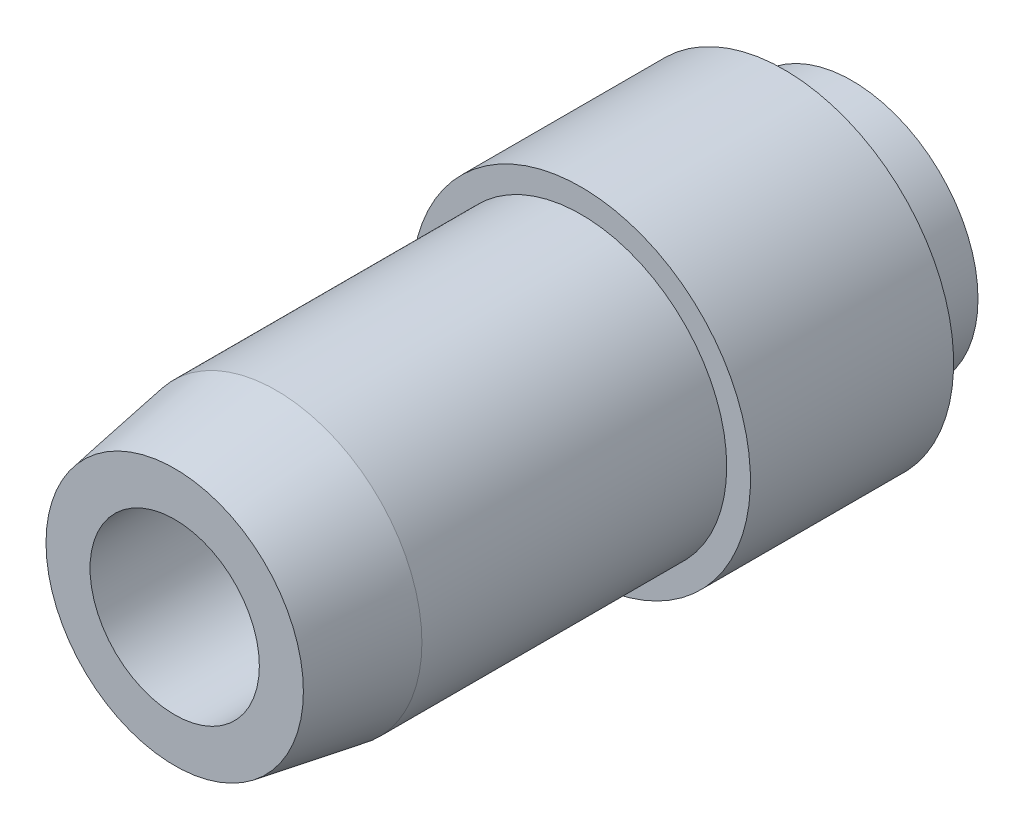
ISO-10303-21;
HEADER;
FILE_DESCRIPTION(('STEP AP214'),'2;1');
FILE_NAME('part.step','',(''),(''),'','','');
FILE_SCHEMA(('AUTOMOTIVE_DESIGN { 1 0 10303 214 1 1 1 1 }'));
ENDSEC;
DATA;
#1=APPLICATION_CONTEXT('core data for automotive mechanical design processes');
#2=APPLICATION_PROTOCOL_DEFINITION('international standard','automotive_design',2000,#1);
#3=PRODUCT_CONTEXT('',#1,'mechanical');
#4=PRODUCT('Part','Part','',(#3));
#5=PRODUCT_RELATED_PRODUCT_CATEGORY('part','',(#4));
#6=PRODUCT_DEFINITION_FORMATION('','',#4);
#7=PRODUCT_DEFINITION_CONTEXT('part definition',#1,'design');
#8=PRODUCT_DEFINITION('design','',#6,#7);
#9=PRODUCT_DEFINITION_SHAPE('','',#8);
#10=(LENGTH_UNIT() NAMED_UNIT(*) SI_UNIT(.MILLI.,.METRE.));
#11=(NAMED_UNIT(*) PLANE_ANGLE_UNIT() SI_UNIT($,.RADIAN.));
#12=(NAMED_UNIT(*) SI_UNIT($,.STERADIAN.) SOLID_ANGLE_UNIT());
#13=UNCERTAINTY_MEASURE_WITH_UNIT(LENGTH_MEASURE(1.E-05),#10,'distance_accuracy_value','');
#14=(GEOMETRIC_REPRESENTATION_CONTEXT(3) GLOBAL_UNCERTAINTY_ASSIGNED_CONTEXT((#13)) GLOBAL_UNIT_ASSIGNED_CONTEXT((#10,
#11,#12)) REPRESENTATION_CONTEXT('',''));
#15=CARTESIAN_POINT('',(0.,0.,0.));
#16=DIRECTION('',(0.,0.,1.));
#17=DIRECTION('',(1.,0.,0.));
#18=AXIS2_PLACEMENT_3D('',#15,#16,#17);
#19=CARTESIAN_POINT('',(0.,0.,10.16));
#20=DIRECTION('',(0.,0.,1.));
#21=DIRECTION('',(1.,0.,0.));
#22=AXIS2_PLACEMENT_3D('',#19,#20,#21);
#23=PLANE('',#22);
#24=CARTESIAN_POINT('',(0.,0.,10.16));
#25=DIRECTION('',(0.,0.,1.));
#26=DIRECTION('',(1.,0.,0.));
#27=AXIS2_PLACEMENT_3D('',#24,#25,#26);
#28=CIRCLE('',#27,6.35);
#29=CARTESIAN_POINT('',(-6.35,0.,10.16));
#30=VERTEX_POINT('',#29);
#31=EDGE_CURVE('E49',#30,#30,#28,.T.);
#32=ORIENTED_EDGE('',*,*,#31,.T.);
#33=EDGE_LOOP('',(#32));
#34=FACE_BOUND('',#33,.T.);
#35=CARTESIAN_POINT('',(0.,0.,10.16));
#36=DIRECTION('',(0.,0.,1.));
#37=DIRECTION('',(1.,0.,0.));
#38=AXIS2_PLACEMENT_3D('',#35,#36,#37);
#39=CIRCLE('',#38,5.461);
#40=CARTESIAN_POINT('',(-5.461,0.,10.16));
#41=VERTEX_POINT('',#40);
#42=EDGE_CURVE('E55',#41,#41,#39,.T.);
#43=ORIENTED_EDGE('',*,*,#42,.F.);
#44=EDGE_LOOP('',(#43));
#45=FACE_BOUND('',#44,.T.);
#46=ADVANCED_FACE('F29',(#34,#45),#23,.T.);
#47=CARTESIAN_POINT('',(0.,0.,2.54));
#48=DIRECTION('',(0.,0.,-1.));
#49=DIRECTION('',(-1.,0.,0.));
#50=AXIS2_PLACEMENT_3D('',#47,#48,#49);
#51=CYLINDRICAL_SURFACE('',#50,4.7244);
#52=CARTESIAN_POINT('',(0.,0.,2.54));
#53=DIRECTION('',(0.,0.,1.));
#54=DIRECTION('',(1.,0.,0.));
#55=AXIS2_PLACEMENT_3D('',#52,#53,#54);
#56=CIRCLE('',#55,4.7244);
#57=CARTESIAN_POINT('',(4.7244,0.,2.54));
#58=VERTEX_POINT('',#57);
#59=EDGE_CURVE('E40',#58,#58,#56,.T.);
#60=ORIENTED_EDGE('',*,*,#59,.F.);
#61=EDGE_LOOP('',(#60));
#62=FACE_BOUND('',#61,.T.);
#63=CARTESIAN_POINT('',(0.,0.,0.));
#64=DIRECTION('',(0.,0.,1.));
#65=DIRECTION('',(1.,0.,0.));
#66=AXIS2_PLACEMENT_3D('',#63,#64,#65);
#67=CIRCLE('',#66,4.7244);
#68=CARTESIAN_POINT('',(4.7244,0.,0.));
#69=VERTEX_POINT('',#68);
#70=EDGE_CURVE('E44',#69,#69,#67,.T.);
#71=ORIENTED_EDGE('',*,*,#70,.T.);
#72=EDGE_LOOP('',(#71));
#73=FACE_BOUND('',#72,.T.);
#74=ADVANCED_FACE('F31',(#62,#73),#51,.T.);
#75=CARTESIAN_POINT('',(0.,0.,0.));
#76=DIRECTION('',(0.,0.,1.));
#77=DIRECTION('',(1.,0.,0.));
#78=AXIS2_PLACEMENT_3D('',#75,#76,#77);
#79=PLANE('',#78);
#80=CARTESIAN_POINT('',(0.,0.,0.));
#81=DIRECTION('',(0.,0.,1.));
#82=DIRECTION('',(1.,0.,0.));
#83=AXIS2_PLACEMENT_3D('',#80,#81,#82);
#84=CIRCLE('',#83,3.175);
#85=CARTESIAN_POINT('',(3.175,0.,0.));
#86=VERTEX_POINT('',#85);
#87=EDGE_CURVE('E58',#86,#86,#84,.T.);
#88=ORIENTED_EDGE('',*,*,#87,.T.);
#89=EDGE_LOOP('',(#88));
#90=FACE_BOUND('',#89,.T.);
#91=ORIENTED_EDGE('',*,*,#70,.F.);
#92=EDGE_LOOP('',(#91));
#93=FACE_BOUND('',#92,.T.);
#94=ADVANCED_FACE('F86',(#90,#93),#79,.F.);
#95=CARTESIAN_POINT('',(0.,0.,2.54));
#96=DIRECTION('',(0.,0.,1.));
#97=DIRECTION('',(1.,0.,0.));
#98=AXIS2_PLACEMENT_3D('',#95,#96,#97);
#99=PLANE('',#98);
#100=CARTESIAN_POINT('',(0.,0.,2.54));
#101=DIRECTION('',(0.,0.,1.));
#102=DIRECTION('',(1.,0.,0.));
#103=AXIS2_PLACEMENT_3D('',#100,#101,#102);
#104=CIRCLE('',#103,6.35);
#105=CARTESIAN_POINT('',(-6.35,0.,2.54));
#106=VERTEX_POINT('',#105);
#107=EDGE_CURVE('E52',#106,#106,#104,.T.);
#108=ORIENTED_EDGE('',*,*,#107,.F.);
#109=EDGE_LOOP('',(#108));
#110=FACE_BOUND('',#109,.T.);
#111=ORIENTED_EDGE('',*,*,#59,.T.);
#112=EDGE_LOOP('',(#111));
#113=FACE_BOUND('',#112,.T.);
#114=ADVANCED_FACE('F91',(#110,#113),#99,.F.);
#115=CARTESIAN_POINT('',(0.,0.,10.16));
#116=DIRECTION('',(0.,0.,-1.));
#117=DIRECTION('',(-1.,0.,0.));
#118=AXIS2_PLACEMENT_3D('',#115,#116,#117);
#119=CYLINDRICAL_SURFACE('',#118,6.35);
#120=CARTESIAN_POINT('',(-6.35,0.,10.16));
#121=CARTESIAN_POINT('',(-6.35,0.,10.080625));
#122=CARTESIAN_POINT('',(-6.35,0.,10.00125));
#123=CARTESIAN_POINT('',(-6.35,0.,9.8425));
#124=CARTESIAN_POINT('',(-6.35,0.,9.763125));
#125=CARTESIAN_POINT('',(-6.35,0.,9.604375));
#126=CARTESIAN_POINT('',(-6.35,0.,9.525));
#127=CARTESIAN_POINT('',(-6.35,0.,9.36625));
#128=CARTESIAN_POINT('',(-6.35,0.,9.286875));
#129=CARTESIAN_POINT('',(-6.35,0.,9.128125));
#130=CARTESIAN_POINT('',(-6.35,0.,9.04875));
#131=CARTESIAN_POINT('',(-6.35,0.,8.89));
#132=CARTESIAN_POINT('',(-6.35,0.,8.810625));
#133=CARTESIAN_POINT('',(-6.35,0.,8.651875));
#134=CARTESIAN_POINT('',(-6.35,0.,8.5725));
#135=CARTESIAN_POINT('',(-6.35,0.,8.41375));
#136=CARTESIAN_POINT('',(-6.35,0.,8.334375));
#137=CARTESIAN_POINT('',(-6.35,0.,8.175625));
#138=CARTESIAN_POINT('',(-6.35,0.,8.09625));
#139=CARTESIAN_POINT('',(-6.35,0.,7.9375));
#140=CARTESIAN_POINT('',(-6.35,0.,7.858125));
#141=CARTESIAN_POINT('',(-6.35,0.,7.699375));
#142=CARTESIAN_POINT('',(-6.35,0.,7.62));
#143=CARTESIAN_POINT('',(-6.35,0.,7.46125));
#144=CARTESIAN_POINT('',(-6.35,0.,7.381875));
#145=CARTESIAN_POINT('',(-6.35,0.,7.223125));
#146=CARTESIAN_POINT('',(-6.35,0.,7.14375));
#147=CARTESIAN_POINT('',(-6.35,0.,6.985));
#148=CARTESIAN_POINT('',(-6.35,0.,6.905625));
#149=CARTESIAN_POINT('',(-6.35,0.,6.746875));
#150=CARTESIAN_POINT('',(-6.35,0.,6.6675));
#151=CARTESIAN_POINT('',(-6.35,0.,6.50875));
#152=CARTESIAN_POINT('',(-6.35,0.,6.429375));
#153=CARTESIAN_POINT('',(-6.35,0.,6.270625));
#154=CARTESIAN_POINT('',(-6.35,0.,6.19125));
#155=CARTESIAN_POINT('',(-6.35,0.,6.0325));
#156=CARTESIAN_POINT('',(-6.35,0.,5.953125));
#157=CARTESIAN_POINT('',(-6.35,0.,5.794375));
#158=CARTESIAN_POINT('',(-6.35,0.,5.715));
#159=CARTESIAN_POINT('',(-6.35,0.,5.55625));
#160=CARTESIAN_POINT('',(-6.35,0.,5.476875));
#161=CARTESIAN_POINT('',(-6.35,0.,5.318125));
#162=CARTESIAN_POINT('',(-6.35,0.,5.23875));
#163=CARTESIAN_POINT('',(-6.35,0.,5.08));
#164=CARTESIAN_POINT('',(-6.35,0.,5.000625));
#165=CARTESIAN_POINT('',(-6.35,0.,4.841875));
#166=CARTESIAN_POINT('',(-6.35,0.,4.7625));
#167=CARTESIAN_POINT('',(-6.35,0.,4.60375));
#168=CARTESIAN_POINT('',(-6.35,0.,4.524375));
#169=CARTESIAN_POINT('',(-6.35,0.,4.365625));
#170=CARTESIAN_POINT('',(-6.35,0.,4.28625));
#171=CARTESIAN_POINT('',(-6.35,0.,4.1275));
#172=CARTESIAN_POINT('',(-6.35,0.,4.048125));
#173=CARTESIAN_POINT('',(-6.35,0.,3.889375));
#174=CARTESIAN_POINT('',(-6.35,0.,3.81));
#175=CARTESIAN_POINT('',(-6.35,0.,3.65125));
#176=CARTESIAN_POINT('',(-6.35,0.,3.571875));
#177=CARTESIAN_POINT('',(-6.35,0.,3.413125));
#178=CARTESIAN_POINT('',(-6.35,0.,3.33375));
#179=CARTESIAN_POINT('',(-6.35,0.,3.175));
#180=CARTESIAN_POINT('',(-6.35,0.,3.095625));
#181=CARTESIAN_POINT('',(-6.35,0.,2.936875));
#182=CARTESIAN_POINT('',(-6.35,0.,2.8575));
#183=CARTESIAN_POINT('',(-6.35,0.,2.69875));
#184=CARTESIAN_POINT('',(-6.35,0.,2.619375));
#185=CARTESIAN_POINT('',(-6.35,0.,2.54));
#186=B_SPLINE_CURVE_WITH_KNOTS('',3,(#120,#121,#122,#123,#124,#125,#126,#127,#128,#129,#130,
#131,#132,#133,#134,#135,#136,#137,#138,#139,#140,#141,#142,#143,#144,#145,#146,#147,#148,#149,
#150,#151,#152,#153,#154,#155,#156,#157,#158,#159,#160,#161,#162,#163,#164,#165,#166,#167,#168,
#169,#170,#171,#172,#173,#174,#175,#176,#177,#178,#179,#180,#181,#182,#183,#184,#185),
.UNSPECIFIED.,.F.,.F.,(4,2,2,2,2,2,2,2,2,2,2,2,2,2,2,2,2,2,2,2,2,2,2,2,2,2,2,2,2,2,2,2,4),(0.,
0.238124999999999,0.476249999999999,0.714375,0.952499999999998,1.190625,1.42875,1.666875,1.905,
2.143125,2.38125,2.619375,2.8575,3.095625,3.33375,3.571875,3.81,4.048125,4.28625,4.524375,
4.7625,5.000625,5.23875,5.476875,5.715,5.953125,6.19125,6.429375,6.6675,6.905625,7.14375,
7.381875,7.62),.UNSPECIFIED.);
#187=EDGE_CURVE('BSEAM78',#30,#106,#186,.T.);
#188=ORIENTED_EDGE('',*,*,#31,.F.);
#189=ORIENTED_EDGE('',*,*,#107,.T.);
#190=ORIENTED_EDGE('',*,*,#187,.T.);
#191=ORIENTED_EDGE('',*,*,#187,.F.);
#192=EDGE_LOOP('',(#188,#190,#189,#191));
#193=FACE_BOUND('',#192,.T.);
#194=ADVANCED_FACE('F78',(#193),#119,.T.);
#195=CARTESIAN_POINT('',(0.,0.,25.4));
#196=DIRECTION('',(0.,0.,-1.));
#197=DIRECTION('',(-1.,0.,0.));
#198=AXIS2_PLACEMENT_3D('',#195,#196,#197);
#199=CYLINDRICAL_SURFACE('',#198,5.461);
#200=CARTESIAN_POINT('',(0.,0.,21.5900000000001));
#201=DIRECTION('',(0.,0.,1.));
#202=DIRECTION('',(1.,0.,0.));
#203=AXIS2_PLACEMENT_3D('',#200,#201,#202);
#204=CIRCLE('',#203,5.461);
#205=CARTESIAN_POINT('',(-5.461,0.,21.5900000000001));
#206=VERTEX_POINT('',#205);
#207=EDGE_CURVE('E10',#206,#206,#204,.F.);
#208=CARTESIAN_POINT('',(-5.461,0.,21.5900000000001));
#209=CARTESIAN_POINT('',(-5.461,0.,21.4709375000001));
#210=CARTESIAN_POINT('',(-5.461,0.,21.3518750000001));
#211=CARTESIAN_POINT('',(-5.461,0.,21.1137500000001));
#212=CARTESIAN_POINT('',(-5.461,0.,20.9946875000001));
#213=CARTESIAN_POINT('',(-5.461,0.,20.7565625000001));
#214=CARTESIAN_POINT('',(-5.461,0.,20.6375000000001));
#215=CARTESIAN_POINT('',(-5.461,0.,20.3993750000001));
#216=CARTESIAN_POINT('',(-5.461,0.,20.2803125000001));
#217=CARTESIAN_POINT('',(-5.461,0.,20.0421875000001));
#218=CARTESIAN_POINT('',(-5.461,0.,19.9231250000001));
#219=CARTESIAN_POINT('',(-5.461,0.,19.6850000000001));
#220=CARTESIAN_POINT('',(-5.461,0.,19.5659375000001));
#221=CARTESIAN_POINT('',(-5.461,0.,19.3278125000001));
#222=CARTESIAN_POINT('',(-5.461,0.,19.20875));
#223=CARTESIAN_POINT('',(-5.461,0.,18.9706250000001));
#224=CARTESIAN_POINT('',(-5.461,0.,18.8515625));
#225=CARTESIAN_POINT('',(-5.461,0.,18.6134375));
#226=CARTESIAN_POINT('',(-5.461,0.,18.494375));
#227=CARTESIAN_POINT('',(-5.461,0.,18.25625));
#228=CARTESIAN_POINT('',(-5.461,0.,18.1371875));
#229=CARTESIAN_POINT('',(-5.461,0.,17.8990625));
#230=CARTESIAN_POINT('',(-5.461,0.,17.78));
#231=CARTESIAN_POINT('',(-5.461,0.,17.541875));
#232=CARTESIAN_POINT('',(-5.461,0.,17.4228125));
#233=CARTESIAN_POINT('',(-5.461,0.,17.1846875));
#234=CARTESIAN_POINT('',(-5.461,0.,17.065625));
#235=CARTESIAN_POINT('',(-5.461,0.,16.8275));
#236=CARTESIAN_POINT('',(-5.461,0.,16.7084375));
#237=CARTESIAN_POINT('',(-5.461,0.,16.4703125));
#238=CARTESIAN_POINT('',(-5.461,0.,16.35125));
#239=CARTESIAN_POINT('',(-5.461,0.,16.113125));
#240=CARTESIAN_POINT('',(-5.461,0.,15.9940625));
#241=CARTESIAN_POINT('',(-5.461,0.,15.7559375));
#242=CARTESIAN_POINT('',(-5.461,0.,15.636875));
#243=CARTESIAN_POINT('',(-5.461,0.,15.39875));
#244=CARTESIAN_POINT('',(-5.461,0.,15.2796875));
#245=CARTESIAN_POINT('',(-5.461,0.,15.0415625));
#246=CARTESIAN_POINT('',(-5.461,0.,14.9225));
#247=CARTESIAN_POINT('',(-5.461,0.,14.684375));
#248=CARTESIAN_POINT('',(-5.461,0.,14.5653125));
#249=CARTESIAN_POINT('',(-5.461,0.,14.3271875));
#250=CARTESIAN_POINT('',(-5.461,0.,14.208125));
#251=CARTESIAN_POINT('',(-5.461,0.,13.97));
#252=CARTESIAN_POINT('',(-5.461,0.,13.8509375));
#253=CARTESIAN_POINT('',(-5.461,0.,13.6128125));
#254=CARTESIAN_POINT('',(-5.461,0.,13.49375));
#255=CARTESIAN_POINT('',(-5.461,0.,13.255625));
#256=CARTESIAN_POINT('',(-5.461,0.,13.1365625));
#257=CARTESIAN_POINT('',(-5.461,0.,12.8984375));
#258=CARTESIAN_POINT('',(-5.461,0.,12.779375));
#259=CARTESIAN_POINT('',(-5.461,0.,12.54125));
#260=CARTESIAN_POINT('',(-5.461,0.,12.4221875));
#261=CARTESIAN_POINT('',(-5.461,0.,12.1840625));
#262=CARTESIAN_POINT('',(-5.461,0.,12.065));
#263=CARTESIAN_POINT('',(-5.461,0.,11.826875));
#264=CARTESIAN_POINT('',(-5.461,0.,11.7078125));
#265=CARTESIAN_POINT('',(-5.461,0.,11.4696875));
#266=CARTESIAN_POINT('',(-5.461,0.,11.350625));
#267=CARTESIAN_POINT('',(-5.461,0.,11.1125));
#268=CARTESIAN_POINT('',(-5.461,0.,10.9934375));
#269=CARTESIAN_POINT('',(-5.461,0.,10.7553125));
#270=CARTESIAN_POINT('',(-5.461,0.,10.63625));
#271=CARTESIAN_POINT('',(-5.461,0.,10.398125));
#272=CARTESIAN_POINT('',(-5.461,0.,10.2790625));
#273=CARTESIAN_POINT('',(-5.461,0.,10.16));
#274=B_SPLINE_CURVE_WITH_KNOTS('',3,(#208,#209,#210,#211,#212,#213,#214,#215,#216,#217,#218,
#219,#220,#221,#222,#223,#224,#225,#226,#227,#228,#229,#230,#231,#232,#233,#234,#235,#236,#237,
#238,#239,#240,#241,#242,#243,#244,#245,#246,#247,#248,#249,#250,#251,#252,#253,#254,#255,#256,
#257,#258,#259,#260,#261,#262,#263,#264,#265,#266,#267,#268,#269,#270,#271,#272,#273),
.UNSPECIFIED.,.F.,.F.,(4,2,2,2,2,2,2,2,2,2,2,2,2,2,2,2,2,2,2,2,2,2,2,2,2,2,2,2,2,2,2,2,4),(0.,
0.357187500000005,0.714375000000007,1.07156250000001,1.42875000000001,1.78593750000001,
2.14312500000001,2.50031250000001,2.85750000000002,3.21468750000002,3.57187500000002,
3.92906250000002,4.28625000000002,4.64343750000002,5.00062500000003,5.35781250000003,
5.71500000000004,6.07218750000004,6.42937500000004,6.78656250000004,7.14375000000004,
7.50093750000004,7.85812500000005,8.21531250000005,8.57250000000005,8.92968750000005,
9.28687500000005,9.64406250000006,10.0012500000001,10.3584375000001,10.7156250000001,
11.0728125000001,11.4300000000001),.UNSPECIFIED.);
#275=EDGE_CURVE('BSEAM69',#206,#41,#274,.T.);
#276=ORIENTED_EDGE('',*,*,#207,.T.);
#277=ORIENTED_EDGE('',*,*,#42,.T.);
#278=ORIENTED_EDGE('',*,*,#275,.T.);
#279=ORIENTED_EDGE('',*,*,#275,.F.);
#280=EDGE_LOOP('',(#276,#278,#277,#279));
#281=FACE_BOUND('',#280,.T.);
#282=ADVANCED_FACE('F69',(#281),#199,.T.);
#283=CARTESIAN_POINT('',(0.,0.,25.4));
#284=DIRECTION('',(0.,0.,1.));
#285=DIRECTION('',(1.,0.,0.));
#286=AXIS2_PLACEMENT_3D('',#283,#284,#285);
#287=PLANE('',#286);
#288=CARTESIAN_POINT('',(0.,0.,25.4));
#289=DIRECTION('',(0.,0.,1.));
#290=DIRECTION('',(1.,0.,0.));
#291=AXIS2_PLACEMENT_3D('',#288,#289,#290);
#292=CIRCLE('',#291,4.82600000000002);
#293=CARTESIAN_POINT('',(4.82600000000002,0.,25.4));
#294=VERTEX_POINT('',#293);
#295=EDGE_CURVE('E36',#294,#294,#292,.T.);
#296=ORIENTED_EDGE('',*,*,#295,.T.);
#297=EDGE_LOOP('',(#296));
#298=FACE_BOUND('',#297,.T.);
#299=CARTESIAN_POINT('',(0.,0.,25.4));
#300=DIRECTION('',(0.,0.,1.));
#301=DIRECTION('',(1.,0.,0.));
#302=AXIS2_PLACEMENT_3D('',#299,#300,#301);
#303=CIRCLE('',#302,3.175);
#304=CARTESIAN_POINT('',(3.175,0.,25.4));
#305=VERTEX_POINT('',#304);
#306=EDGE_CURVE('E61',#305,#305,#303,.T.);
#307=ORIENTED_EDGE('',*,*,#306,.F.);
#308=EDGE_LOOP('',(#307));
#309=FACE_BOUND('',#308,.T.);
#310=ADVANCED_FACE('F67',(#298,#309),#287,.T.);
#311=CARTESIAN_POINT('',(0.,0.,0.));
#312=DIRECTION('',(0.,0.,1.));
#313=DIRECTION('',(1.,0.,0.));
#314=AXIS2_PLACEMENT_3D('',#311,#312,#313);
#315=CYLINDRICAL_SURFACE('',#314,3.175);
#316=ORIENTED_EDGE('',*,*,#87,.F.);
#317=EDGE_LOOP('',(#316));
#318=FACE_BOUND('',#317,.T.);
#319=ORIENTED_EDGE('',*,*,#306,.T.);
#320=EDGE_LOOP('',(#319));
#321=FACE_BOUND('',#320,.T.);
#322=ADVANCED_FACE('F65',(#318,#321),#315,.F.);
#323=CARTESIAN_POINT('',(0.,0.,25.4));
#324=DIRECTION('',(0.,0.,-1.));
#325=DIRECTION('',(-1.,0.,0.));
#326=AXIS2_PLACEMENT_3D('',#323,#324,#325);
#327=CONICAL_SURFACE('',#326,4.82600000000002,0.165148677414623);
#328=ORIENTED_EDGE('',*,*,#207,.F.);
#329=EDGE_LOOP('',(#328));
#330=FACE_BOUND('',#329,.T.);
#331=ORIENTED_EDGE('',*,*,#295,.F.);
#332=EDGE_LOOP('',(#331));
#333=FACE_BOUND('',#332,.T.);
#334=ADVANCED_FACE('F75',(#330,#333),#327,.T.);
#335=CLOSED_SHELL('',(#46,#74,#94,#114,#194,#282,#310,#322,#334));
#336=MANIFOLD_SOLID_BREP('B2',#335);
#337=ADVANCED_BREP_SHAPE_REPRESENTATION('',(#18,#336),#14);
#338=SHAPE_DEFINITION_REPRESENTATION(#9,#337);
ENDSEC;
END-ISO-10303-21;
